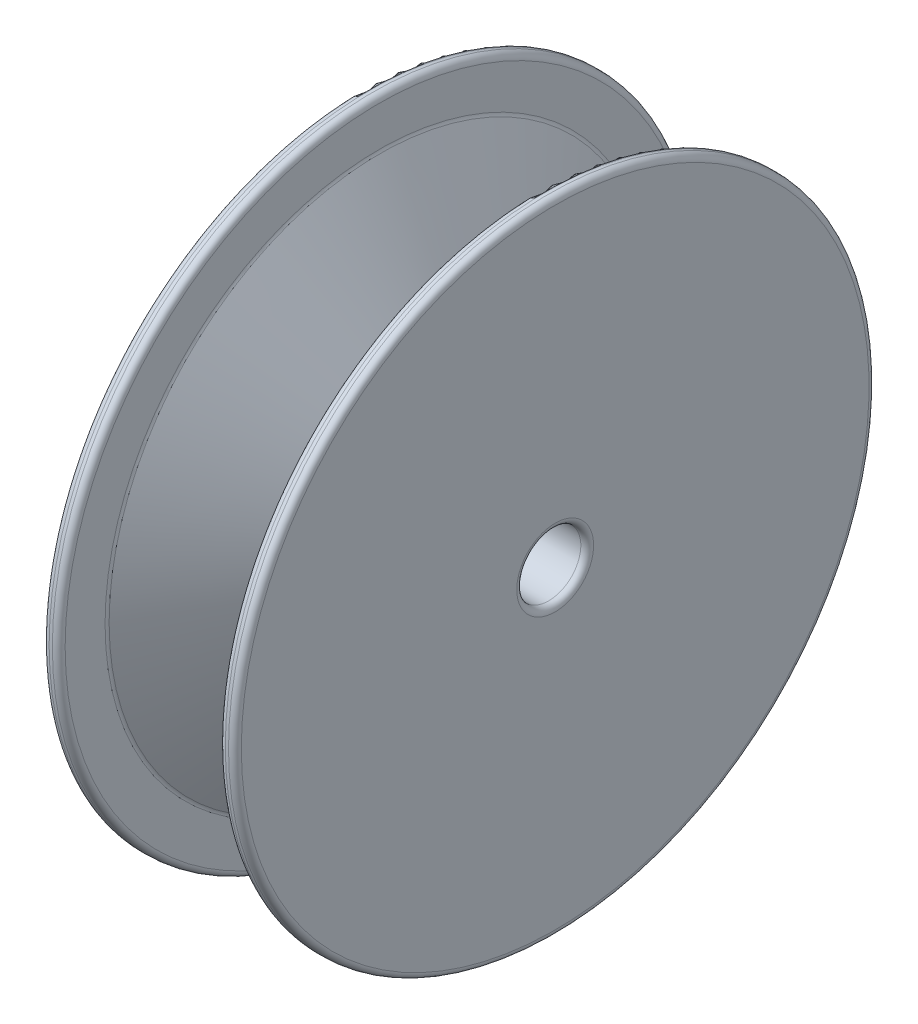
from build123d import *

# Parameters (mm, degrees)
CONG_1_R                = 0.2
ESQUISSE2_R             = 0.84342655
ENL_V_MAT_EXTRU_1_DEPTH = 0.25


with BuildPart() as part:
    # Esquisse1 → R_volution2 (revolve)
    with BuildSketch(Plane.XY, mode=Mode.PRIVATE) as r_volution2_sk:
        Polygon((-2.5, 8.5), (0, 4.169872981), (2.5, 8.5), (2.5, 10), (3, 10), (3, 1), (-3, 1), (-3, 10), (-2.5, 10), align=None)
    revolve(r_volution2_sk.sketch.rotate(Axis((0, 0, 0), (1, 0, 0)), 90), axis=Axis((0, 0, 0), (1, 0, 0)))

    # Cong_1
    cong_1_edges = [part.edges().sort_by_distance(p)[0] for p in [
        (3, 0, -1),
        (-3, 0, -1),
        (-3, 0, -10),
        (-2.5, 0, -10),
        (-2.5, 0, -8.5),
        (0, 0, -4.169872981),
        (2.5, 0, -8.5),
        (2.5, 0, -10),
        (3, 0, -10),
    ]]
    fillet(cong_1_edges, radius=CONG_1_R)

    # Esquisse2 → Enl_v. mat.-Extru.1 (cut)
    with BuildSketch(Plane.ZY.offset(3)):
        with Locations((0, 6.530038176)):
            Circle(ESQUISSE2_R)
        with Locations(Location((0, -6.530038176, 0), (0, 0, 180))):
            Circle(ESQUISSE2_R)
    extrude(amount=-ENL_V_MAT_EXTRU_1_DEPTH, mode=Mode.SUBTRACT)


solid = part.part
